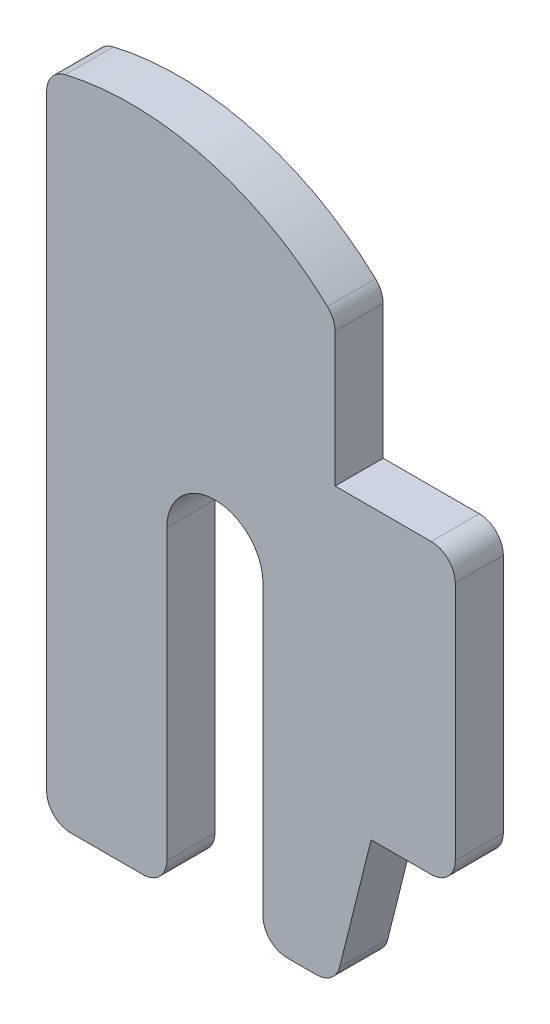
ISO-10303-21;
HEADER;
FILE_DESCRIPTION(('STEP AP214'),'2;1');
FILE_NAME('part.step','',(''),(''),'','','');
FILE_SCHEMA(('AUTOMOTIVE_DESIGN { 1 0 10303 214 1 1 1 1 }'));
ENDSEC;
DATA;
#1=APPLICATION_CONTEXT('core data for automotive mechanical design processes');
#2=APPLICATION_PROTOCOL_DEFINITION('international standard','automotive_design',2000,#1);
#3=PRODUCT_CONTEXT('',#1,'mechanical');
#4=PRODUCT('Part','Part','',(#3));
#5=PRODUCT_RELATED_PRODUCT_CATEGORY('part','',(#4));
#6=PRODUCT_DEFINITION_FORMATION('','',#4);
#7=PRODUCT_DEFINITION_CONTEXT('part definition',#1,'design');
#8=PRODUCT_DEFINITION('design','',#6,#7);
#9=PRODUCT_DEFINITION_SHAPE('','',#8);
#10=(LENGTH_UNIT() NAMED_UNIT(*) SI_UNIT(.MILLI.,.METRE.));
#11=(NAMED_UNIT(*) PLANE_ANGLE_UNIT() SI_UNIT($,.RADIAN.));
#12=(NAMED_UNIT(*) SI_UNIT($,.STERADIAN.) SOLID_ANGLE_UNIT());
#13=UNCERTAINTY_MEASURE_WITH_UNIT(LENGTH_MEASURE(1.E-05),#10,'distance_accuracy_value','');
#14=(GEOMETRIC_REPRESENTATION_CONTEXT(3) GLOBAL_UNCERTAINTY_ASSIGNED_CONTEXT((#13)) GLOBAL_UNIT_ASSIGNED_CONTEXT((#10,
#11,#12)) REPRESENTATION_CONTEXT('',''));
#15=CARTESIAN_POINT('',(0.,0.,0.));
#16=DIRECTION('',(0.,0.,1.));
#17=DIRECTION('',(1.,0.,0.));
#18=AXIS2_PLACEMENT_3D('',#15,#16,#17);
#19=CARTESIAN_POINT('',(12.,18.,2.));
#20=DIRECTION('',(0.,-1.,0.));
#21=DIRECTION('',(0.,0.,-1.));
#22=AXIS2_PLACEMENT_3D('',#19,#20,#21);
#23=PLANE('',#22);
#24=DIRECTION('',(-1.,0.,0.));
#25=VECTOR('',#24,1.);
#26=CARTESIAN_POINT('',(12.,18.,0.));
#27=LINE('',#26,#25);
#28=CARTESIAN_POINT('',(16.,18.,0.));
#29=VERTEX_POINT('',#28);
#30=CARTESIAN_POINT('',(12.,18.,0.));
#31=VERTEX_POINT('',#30);
#32=EDGE_CURVE('E200',#29,#31,#27,.T.);
#33=ORIENTED_EDGE('',*,*,#32,.T.);
#34=DIRECTION('',(0.,0.,-1.));
#35=VECTOR('',#34,1.);
#36=CARTESIAN_POINT('',(12.,18.,2.));
#37=LINE('',#36,#35);
#38=CARTESIAN_POINT('',(12.,18.,2.));
#39=VERTEX_POINT('',#38);
#40=EDGE_CURVE('E11',#39,#31,#37,.T.);
#41=ORIENTED_EDGE('',*,*,#40,.F.);
#42=DIRECTION('',(-1.,0.,0.));
#43=VECTOR('',#42,1.);
#44=CARTESIAN_POINT('',(12.,18.,2.));
#45=LINE('',#44,#43);
#46=CARTESIAN_POINT('',(16.,18.,2.));
#47=VERTEX_POINT('',#46);
#48=EDGE_CURVE('E238',#47,#39,#45,.T.);
#49=ORIENTED_EDGE('',*,*,#48,.F.);
#50=DIRECTION('',(0.,0.,-1.));
#51=VECTOR('',#50,1.);
#52=CARTESIAN_POINT('',(16.,18.,2.));
#53=LINE('',#52,#51);
#54=EDGE_CURVE('E196',#47,#29,#53,.T.);
#55=ORIENTED_EDGE('',*,*,#54,.T.);
#56=EDGE_LOOP('',(#33,#41,#49,#55));
#57=FACE_BOUND('',#56,.T.);
#58=ADVANCED_FACE('F32',(#57),#23,.F.);
#59=CARTESIAN_POINT('',(12.,23.5757807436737,2.));
#60=DIRECTION('',(-1.,0.,0.));
#61=DIRECTION('',(0.,0.,1.));
#62=AXIS2_PLACEMENT_3D('',#59,#60,#61);
#63=PLANE('',#62);
#64=DIRECTION('',(0.,1.,0.));
#65=VECTOR('',#64,1.);
#66=CARTESIAN_POINT('',(12.,23.5757807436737,0.));
#67=LINE('',#66,#65);
#68=CARTESIAN_POINT('',(12.,23.5757807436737,0.));
#69=VERTEX_POINT('',#68);
#70=EDGE_CURVE('E203',#31,#69,#67,.T.);
#71=ORIENTED_EDGE('',*,*,#70,.T.);
#72=DIRECTION('',(0.,0.,-1.));
#73=VECTOR('',#72,1.);
#74=CARTESIAN_POINT('',(12.,23.5757807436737,2.));
#75=LINE('',#74,#73);
#76=CARTESIAN_POINT('',(12.,23.5757807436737,2.));
#77=VERTEX_POINT('',#76);
#78=EDGE_CURVE('E40',#77,#69,#75,.T.);
#79=ORIENTED_EDGE('',*,*,#78,.F.);
#80=DIRECTION('',(0.,1.,0.));
#81=VECTOR('',#80,1.);
#82=CARTESIAN_POINT('',(12.,23.5757807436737,2.));
#83=LINE('',#82,#81);
#84=EDGE_CURVE('E127',#39,#77,#83,.T.);
#85=ORIENTED_EDGE('',*,*,#84,.F.);
#86=ORIENTED_EDGE('',*,*,#40,.T.);
#87=EDGE_LOOP('',(#71,#79,#85,#86));
#88=FACE_BOUND('',#87,.T.);
#89=ADVANCED_FACE('F356',(#88),#63,.F.);
#90=CARTESIAN_POINT('',(11.,23.5757807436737,2.));
#91=DIRECTION('',(0.,0.,-1.));
#92=DIRECTION('',(-1.,0.,0.));
#93=AXIS2_PLACEMENT_3D('',#90,#91,#92);
#94=CYLINDRICAL_SURFACE('',#93,1.);
#95=CARTESIAN_POINT('',(11.,23.5757807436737,0.));
#96=DIRECTION('',(0.,0.,1.));
#97=DIRECTION('',(-1.,0.,0.));
#98=AXIS2_PLACEMENT_3D('',#95,#96,#97);
#99=CIRCLE('',#98,1.);
#100=CARTESIAN_POINT('',(11.6812827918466,24.3078010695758,0.));
#101=VERTEX_POINT('',#100);
#102=EDGE_CURVE('E205',#69,#101,#99,.T.);
#103=ORIENTED_EDGE('',*,*,#102,.T.);
#104=DIRECTION('',(0.,0.,-1.));
#105=VECTOR('',#104,1.);
#106=CARTESIAN_POINT('',(11.6812827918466,24.3078010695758,2.));
#107=LINE('',#106,#105);
#108=CARTESIAN_POINT('',(11.6812827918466,24.3078010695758,2.));
#109=VERTEX_POINT('',#108);
#110=EDGE_CURVE('E281',#109,#101,#107,.T.);
#111=ORIENTED_EDGE('',*,*,#110,.F.);
#112=CARTESIAN_POINT('',(11.,23.5757807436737,2.));
#113=DIRECTION('',(0.,0.,1.));
#114=DIRECTION('',(-1.,0.,0.));
#115=AXIS2_PLACEMENT_3D('',#112,#113,#114);
#116=CIRCLE('',#115,1.);
#117=EDGE_CURVE('E289',#77,#109,#116,.T.);
#118=ORIENTED_EDGE('',*,*,#117,.F.);
#119=ORIENTED_EDGE('',*,*,#78,.T.);
#120=EDGE_LOOP('',(#103,#111,#118,#119));
#121=FACE_BOUND('',#120,.T.);
#122=ADVANCED_FACE('F287',(#121),#94,.T.);
#123=CARTESIAN_POINT('',(3.50588928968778,15.5235571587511,2.));
#124=DIRECTION('',(0.,0.,-1.));
#125=DIRECTION('',(-1.,0.,0.));
#126=AXIS2_PLACEMENT_3D('',#123,#124,#125);
#127=CYLINDRICAL_SURFACE('',#126,12.);
#128=CARTESIAN_POINT('',(3.50588928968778,15.5235571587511,0.));
#129=DIRECTION('',(0.,0.,1.));
#130=DIRECTION('',(-1.,0.,0.));
#131=AXIS2_PLACEMENT_3D('',#128,#129,#130);
#132=CIRCLE('',#131,12.);
#133=CARTESIAN_POINT('',(0.772191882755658,27.2080296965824,0.));
#134=VERTEX_POINT('',#133);
#135=EDGE_CURVE('E207',#101,#134,#132,.T.);
#136=ORIENTED_EDGE('',*,*,#135,.T.);
#137=DIRECTION('',(0.,0.,-1.));
#138=VECTOR('',#137,1.);
#139=CARTESIAN_POINT('',(0.772191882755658,27.2080296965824,2.));
#140=LINE('',#139,#138);
#141=CARTESIAN_POINT('',(0.772191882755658,27.2080296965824,2.));
#142=VERTEX_POINT('',#141);
#143=EDGE_CURVE('E278',#142,#134,#140,.T.);
#144=ORIENTED_EDGE('',*,*,#143,.F.);
#145=CARTESIAN_POINT('',(3.50588928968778,15.5235571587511,2.));
#146=DIRECTION('',(0.,0.,1.));
#147=DIRECTION('',(-1.,0.,0.));
#148=AXIS2_PLACEMENT_3D('',#145,#146,#147);
#149=CIRCLE('',#148,12.);
#150=EDGE_CURVE('E307',#109,#142,#149,.T.);
#151=ORIENTED_EDGE('',*,*,#150,.F.);
#152=ORIENTED_EDGE('',*,*,#110,.T.);
#153=EDGE_LOOP('',(#136,#144,#151,#152));
#154=FACE_BOUND('',#153,.T.);
#155=ADVANCED_FACE('F298',(#154),#127,.T.);
#156=CARTESIAN_POINT('',(1.,26.2343236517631,2.));
#157=DIRECTION('',(0.,0.,-1.));
#158=DIRECTION('',(-1.,0.,0.));
#159=AXIS2_PLACEMENT_3D('',#156,#157,#158);
#160=CYLINDRICAL_SURFACE('',#159,1.);
#161=CARTESIAN_POINT('',(1.,26.2343236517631,0.));
#162=DIRECTION('',(0.,0.,1.));
#163=DIRECTION('',(-1.,0.,0.));
#164=AXIS2_PLACEMENT_3D('',#161,#162,#163);
#165=CIRCLE('',#164,1.);
#166=CARTESIAN_POINT('',(0.,26.2343236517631,0.));
#167=VERTEX_POINT('',#166);
#168=EDGE_CURVE('E209',#134,#167,#165,.T.);
#169=ORIENTED_EDGE('',*,*,#168,.T.);
#170=DIRECTION('',(0.,0.,-1.));
#171=VECTOR('',#170,1.);
#172=CARTESIAN_POINT('',(0.,26.2343236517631,2.));
#173=LINE('',#172,#171);
#174=CARTESIAN_POINT('',(0.,26.2343236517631,2.));
#175=VERTEX_POINT('',#174);
#176=EDGE_CURVE('E275',#175,#167,#173,.T.);
#177=ORIENTED_EDGE('',*,*,#176,.F.);
#178=CARTESIAN_POINT('',(1.,26.2343236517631,2.));
#179=DIRECTION('',(0.,0.,1.));
#180=DIRECTION('',(-1.,0.,0.));
#181=AXIS2_PLACEMENT_3D('',#178,#179,#180);
#182=CIRCLE('',#181,1.);
#183=EDGE_CURVE('E304',#142,#175,#182,.T.);
#184=ORIENTED_EDGE('',*,*,#183,.F.);
#185=ORIENTED_EDGE('',*,*,#143,.T.);
#186=EDGE_LOOP('',(#169,#177,#184,#185));
#187=FACE_BOUND('',#186,.T.);
#188=ADVANCED_FACE('F302',(#187),#160,.T.);
#189=CARTESIAN_POINT('',(0.,1.00000000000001,2.));
#190=DIRECTION('',(1.,0.,0.));
#191=DIRECTION('',(0.,0.,-1.));
#192=AXIS2_PLACEMENT_3D('',#189,#190,#191);
#193=PLANE('',#192);
#194=DIRECTION('',(0.,-1.,0.));
#195=VECTOR('',#194,1.);
#196=CARTESIAN_POINT('',(0.,1.00000000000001,0.));
#197=LINE('',#196,#195);
#198=CARTESIAN_POINT('',(0.,1.00000000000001,0.));
#199=VERTEX_POINT('',#198);
#200=EDGE_CURVE('E211',#167,#199,#197,.T.);
#201=ORIENTED_EDGE('',*,*,#200,.T.);
#202=DIRECTION('',(0.,0.,-1.));
#203=VECTOR('',#202,1.);
#204=CARTESIAN_POINT('',(0.,1.00000000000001,2.));
#205=LINE('',#204,#203);
#206=CARTESIAN_POINT('',(0.,1.00000000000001,2.));
#207=VERTEX_POINT('',#206);
#208=EDGE_CURVE('E272',#207,#199,#205,.T.);
#209=ORIENTED_EDGE('',*,*,#208,.F.);
#210=DIRECTION('',(0.,-1.,0.));
#211=VECTOR('',#210,1.);
#212=CARTESIAN_POINT('',(0.,1.00000000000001,2.));
#213=LINE('',#212,#211);
#214=EDGE_CURVE('E306',#175,#207,#213,.T.);
#215=ORIENTED_EDGE('',*,*,#214,.F.);
#216=ORIENTED_EDGE('',*,*,#176,.T.);
#217=EDGE_LOOP('',(#201,#209,#215,#216));
#218=FACE_BOUND('',#217,.T.);
#219=ADVANCED_FACE('F369',(#218),#193,.F.);
#220=CARTESIAN_POINT('',(1.,1.,2.));
#221=DIRECTION('',(0.,0.,-1.));
#222=DIRECTION('',(-1.,0.,0.));
#223=AXIS2_PLACEMENT_3D('',#220,#221,#222);
#224=CYLINDRICAL_SURFACE('',#223,1.);
#225=CARTESIAN_POINT('',(1.,1.,0.));
#226=DIRECTION('',(0.,0.,1.));
#227=DIRECTION('',(1.,0.,0.));
#228=AXIS2_PLACEMENT_3D('',#225,#226,#227);
#229=CIRCLE('',#228,1.);
#230=CARTESIAN_POINT('',(1.00000000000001,0.,0.));
#231=VERTEX_POINT('',#230);
#232=EDGE_CURVE('E213',#199,#231,#229,.T.);
#233=ORIENTED_EDGE('',*,*,#232,.T.);
#234=DIRECTION('',(0.,0.,-1.));
#235=VECTOR('',#234,1.);
#236=CARTESIAN_POINT('',(1.00000000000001,0.,2.));
#237=LINE('',#236,#235);
#238=CARTESIAN_POINT('',(1.00000000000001,0.,2.));
#239=VERTEX_POINT('',#238);
#240=EDGE_CURVE('E269',#239,#231,#237,.T.);
#241=ORIENTED_EDGE('',*,*,#240,.F.);
#242=CARTESIAN_POINT('',(1.,1.,2.));
#243=DIRECTION('',(0.,0.,1.));
#244=DIRECTION('',(1.,0.,0.));
#245=AXIS2_PLACEMENT_3D('',#242,#243,#244);
#246=CIRCLE('',#245,1.);
#247=EDGE_CURVE('E309',#207,#239,#246,.T.);
#248=ORIENTED_EDGE('',*,*,#247,.F.);
#249=ORIENTED_EDGE('',*,*,#208,.T.);
#250=EDGE_LOOP('',(#233,#241,#248,#249));
#251=FACE_BOUND('',#250,.T.);
#252=ADVANCED_FACE('F372',(#251),#224,.T.);
#253=CARTESIAN_POINT('',(1.00000000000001,0.,2.));
#254=DIRECTION('',(0.,1.,0.));
#255=DIRECTION('',(0.,0.,1.));
#256=AXIS2_PLACEMENT_3D('',#253,#254,#255);
#257=PLANE('',#256);
#258=DIRECTION('',(1.,0.,0.));
#259=VECTOR('',#258,1.);
#260=CARTESIAN_POINT('',(1.00000000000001,0.,0.));
#261=LINE('',#260,#259);
#262=CARTESIAN_POINT('',(3.99999999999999,0.,0.));
#263=VERTEX_POINT('',#262);
#264=EDGE_CURVE('E215',#231,#263,#261,.T.);
#265=ORIENTED_EDGE('',*,*,#264,.T.);
#266=DIRECTION('',(0.,0.,-1.));
#267=VECTOR('',#266,1.);
#268=CARTESIAN_POINT('',(3.99999999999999,0.,2.));
#269=LINE('',#268,#267);
#270=CARTESIAN_POINT('',(3.99999999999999,0.,2.));
#271=VERTEX_POINT('',#270);
#272=EDGE_CURVE('E266',#271,#263,#269,.T.);
#273=ORIENTED_EDGE('',*,*,#272,.F.);
#274=DIRECTION('',(1.,0.,0.));
#275=VECTOR('',#274,1.);
#276=CARTESIAN_POINT('',(1.00000000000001,0.,2.));
#277=LINE('',#276,#275);
#278=EDGE_CURVE('E315',#239,#271,#277,.T.);
#279=ORIENTED_EDGE('',*,*,#278,.F.);
#280=ORIENTED_EDGE('',*,*,#240,.T.);
#281=EDGE_LOOP('',(#265,#273,#279,#280));
#282=FACE_BOUND('',#281,.T.);
#283=ADVANCED_FACE('F376',(#282),#257,.F.);
#284=CARTESIAN_POINT('',(4.,1.,2.));
#285=DIRECTION('',(0.,0.,-1.));
#286=DIRECTION('',(-1.,0.,0.));
#287=AXIS2_PLACEMENT_3D('',#284,#285,#286);
#288=CYLINDRICAL_SURFACE('',#287,1.);
#289=CARTESIAN_POINT('',(4.,1.,0.));
#290=DIRECTION('',(0.,0.,1.));
#291=DIRECTION('',(1.,0.,0.));
#292=AXIS2_PLACEMENT_3D('',#289,#290,#291);
#293=CIRCLE('',#292,1.);
#294=CARTESIAN_POINT('',(5.,1.00000000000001,0.));
#295=VERTEX_POINT('',#294);
#296=EDGE_CURVE('E217',#263,#295,#293,.T.);
#297=ORIENTED_EDGE('',*,*,#296,.T.);
#298=DIRECTION('',(0.,0.,-1.));
#299=VECTOR('',#298,1.);
#300=CARTESIAN_POINT('',(5.,1.00000000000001,2.));
#301=LINE('',#300,#299);
#302=CARTESIAN_POINT('',(5.,1.00000000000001,2.));
#303=VERTEX_POINT('',#302);
#304=EDGE_CURVE('E263',#303,#295,#301,.T.);
#305=ORIENTED_EDGE('',*,*,#304,.F.);
#306=CARTESIAN_POINT('',(4.,1.,2.));
#307=DIRECTION('',(0.,0.,1.));
#308=DIRECTION('',(1.,0.,0.));
#309=AXIS2_PLACEMENT_3D('',#306,#307,#308);
#310=CIRCLE('',#309,1.);
#311=EDGE_CURVE('E317',#271,#303,#310,.T.);
#312=ORIENTED_EDGE('',*,*,#311,.F.);
#313=ORIENTED_EDGE('',*,*,#272,.T.);
#314=EDGE_LOOP('',(#297,#305,#312,#313));
#315=FACE_BOUND('',#314,.T.);
#316=ADVANCED_FACE('F380',(#315),#288,.T.);
#317=CARTESIAN_POINT('',(5.,1.00000000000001,2.));
#318=DIRECTION('',(-1.,0.,0.));
#319=DIRECTION('',(0.,0.,1.));
#320=AXIS2_PLACEMENT_3D('',#317,#318,#319);
#321=PLANE('',#320);
#322=DIRECTION('',(0.,1.,0.));
#323=VECTOR('',#322,1.);
#324=CARTESIAN_POINT('',(5.,1.00000000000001,0.));
#325=LINE('',#324,#323);
#326=CARTESIAN_POINT('',(5.,13.,0.));
#327=VERTEX_POINT('',#326);
#328=EDGE_CURVE('E219',#295,#327,#325,.T.);
#329=ORIENTED_EDGE('',*,*,#328,.T.);
#330=DIRECTION('',(0.,0.,-1.));
#331=VECTOR('',#330,1.);
#332=CARTESIAN_POINT('',(5.,13.,2.));
#333=LINE('',#332,#331);
#334=CARTESIAN_POINT('',(5.,13.,2.));
#335=VERTEX_POINT('',#334);
#336=EDGE_CURVE('E260',#335,#327,#333,.T.);
#337=ORIENTED_EDGE('',*,*,#336,.F.);
#338=DIRECTION('',(0.,1.,0.));
#339=VECTOR('',#338,1.);
#340=CARTESIAN_POINT('',(5.,1.00000000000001,2.));
#341=LINE('',#340,#339);
#342=EDGE_CURVE('E319',#303,#335,#341,.T.);
#343=ORIENTED_EDGE('',*,*,#342,.F.);
#344=ORIENTED_EDGE('',*,*,#304,.T.);
#345=EDGE_LOOP('',(#329,#337,#343,#344));
#346=FACE_BOUND('',#345,.T.);
#347=ADVANCED_FACE('F384',(#346),#321,.F.);
#348=CARTESIAN_POINT('',(7.,13.,2.));
#349=DIRECTION('',(0.,0.,-1.));
#350=DIRECTION('',(-1.,0.,0.));
#351=AXIS2_PLACEMENT_3D('',#348,#349,#350);
#352=CYLINDRICAL_SURFACE('',#351,2.);
#353=CARTESIAN_POINT('',(7.,13.,0.));
#354=DIRECTION('',(0.,0.,-1.));
#355=DIRECTION('',(1.,0.,0.));
#356=AXIS2_PLACEMENT_3D('',#353,#354,#355);
#357=CIRCLE('',#356,2.);
#358=CARTESIAN_POINT('',(9.,13.,0.));
#359=VERTEX_POINT('',#358);
#360=EDGE_CURVE('E221',#327,#359,#357,.T.);
#361=ORIENTED_EDGE('',*,*,#360,.T.);
#362=DIRECTION('',(0.,0.,-1.));
#363=VECTOR('',#362,1.);
#364=CARTESIAN_POINT('',(9.,13.,2.));
#365=LINE('',#364,#363);
#366=CARTESIAN_POINT('',(9.,13.,2.));
#367=VERTEX_POINT('',#366);
#368=EDGE_CURVE('E257',#367,#359,#365,.T.);
#369=ORIENTED_EDGE('',*,*,#368,.F.);
#370=CARTESIAN_POINT('',(7.,13.,2.));
#371=DIRECTION('',(0.,0.,-1.));
#372=DIRECTION('',(1.,0.,0.));
#373=AXIS2_PLACEMENT_3D('',#370,#371,#372);
#374=CIRCLE('',#373,2.);
#375=EDGE_CURVE('E321',#335,#367,#374,.T.);
#376=ORIENTED_EDGE('',*,*,#375,.F.);
#377=ORIENTED_EDGE('',*,*,#336,.T.);
#378=EDGE_LOOP('',(#361,#369,#376,#377));
#379=FACE_BOUND('',#378,.T.);
#380=ADVANCED_FACE('F388',(#379),#352,.F.);
#381=CARTESIAN_POINT('',(9.,1.00000000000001,2.));
#382=DIRECTION('',(1.,0.,0.));
#383=DIRECTION('',(0.,0.,-1.));
#384=AXIS2_PLACEMENT_3D('',#381,#382,#383);
#385=PLANE('',#384);
#386=DIRECTION('',(0.,-1.,0.));
#387=VECTOR('',#386,1.);
#388=CARTESIAN_POINT('',(9.,1.00000000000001,0.));
#389=LINE('',#388,#387);
#390=CARTESIAN_POINT('',(9.,1.00000000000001,0.));
#391=VERTEX_POINT('',#390);
#392=EDGE_CURVE('E223',#359,#391,#389,.T.);
#393=ORIENTED_EDGE('',*,*,#392,.T.);
#394=DIRECTION('',(0.,0.,-1.));
#395=VECTOR('',#394,1.);
#396=CARTESIAN_POINT('',(9.,1.00000000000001,2.));
#397=LINE('',#396,#395);
#398=CARTESIAN_POINT('',(9.,1.00000000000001,2.));
#399=VERTEX_POINT('',#398);
#400=EDGE_CURVE('E254',#399,#391,#397,.T.);
#401=ORIENTED_EDGE('',*,*,#400,.F.);
#402=DIRECTION('',(0.,-1.,0.));
#403=VECTOR('',#402,1.);
#404=CARTESIAN_POINT('',(9.,1.00000000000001,2.));
#405=LINE('',#404,#403);
#406=EDGE_CURVE('E323',#367,#399,#405,.T.);
#407=ORIENTED_EDGE('',*,*,#406,.F.);
#408=ORIENTED_EDGE('',*,*,#368,.T.);
#409=EDGE_LOOP('',(#393,#401,#407,#408));
#410=FACE_BOUND('',#409,.T.);
#411=ADVANCED_FACE('F392',(#410),#385,.F.);
#412=CARTESIAN_POINT('',(10.,1.,2.));
#413=DIRECTION('',(0.,0.,-1.));
#414=DIRECTION('',(-1.,0.,0.));
#415=AXIS2_PLACEMENT_3D('',#412,#413,#414);
#416=CYLINDRICAL_SURFACE('',#415,1.);
#417=CARTESIAN_POINT('',(10.,1.,0.));
#418=DIRECTION('',(0.,0.,1.));
#419=DIRECTION('',(-1.,0.,0.));
#420=AXIS2_PLACEMENT_3D('',#417,#418,#419);
#421=CIRCLE('',#420,1.);
#422=CARTESIAN_POINT('',(10.,0.,0.));
#423=VERTEX_POINT('',#422);
#424=EDGE_CURVE('E225',#391,#423,#421,.T.);
#425=ORIENTED_EDGE('',*,*,#424,.T.);
#426=DIRECTION('',(0.,0.,-1.));
#427=VECTOR('',#426,1.);
#428=CARTESIAN_POINT('',(10.,0.,2.));
#429=LINE('',#428,#427);
#430=CARTESIAN_POINT('',(10.,0.,2.));
#431=VERTEX_POINT('',#430);
#432=EDGE_CURVE('E251',#431,#423,#429,.T.);
#433=ORIENTED_EDGE('',*,*,#432,.F.);
#434=CARTESIAN_POINT('',(10.,1.,2.));
#435=DIRECTION('',(0.,0.,1.));
#436=DIRECTION('',(-1.,0.,0.));
#437=AXIS2_PLACEMENT_3D('',#434,#435,#436);
#438=CIRCLE('',#437,1.);
#439=EDGE_CURVE('E325',#399,#431,#438,.T.);
#440=ORIENTED_EDGE('',*,*,#439,.F.);
#441=ORIENTED_EDGE('',*,*,#400,.T.);
#442=EDGE_LOOP('',(#425,#433,#440,#441));
#443=FACE_BOUND('',#442,.T.);
#444=ADVANCED_FACE('F396',(#443),#416,.T.);
#445=CARTESIAN_POINT('',(11.2192235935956,0.,2.));
#446=DIRECTION('',(0.,1.,0.));
#447=DIRECTION('',(-1.,0.,0.));
#448=AXIS2_PLACEMENT_3D('',#445,#446,#447);
#449=PLANE('',#448);
#450=DIRECTION('',(1.,0.,0.));
#451=VECTOR('',#450,1.);
#452=CARTESIAN_POINT('',(11.2192235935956,0.,0.));
#453=LINE('',#452,#451);
#454=CARTESIAN_POINT('',(11.2192235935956,0.,0.));
#455=VERTEX_POINT('',#454);
#456=EDGE_CURVE('E227',#423,#455,#453,.T.);
#457=ORIENTED_EDGE('',*,*,#456,.T.);
#458=DIRECTION('',(0.,0.,-1.));
#459=VECTOR('',#458,1.);
#460=CARTESIAN_POINT('',(11.2192235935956,0.,2.));
#461=LINE('',#460,#459);
#462=CARTESIAN_POINT('',(11.2192235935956,0.,2.));
#463=VERTEX_POINT('',#462);
#464=EDGE_CURVE('E248',#463,#455,#461,.T.);
#465=ORIENTED_EDGE('',*,*,#464,.F.);
#466=DIRECTION('',(1.,0.,0.));
#467=VECTOR('',#466,1.);
#468=CARTESIAN_POINT('',(11.2192235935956,0.,2.));
#469=LINE('',#468,#467);
#470=EDGE_CURVE('E327',#431,#463,#469,.T.);
#471=ORIENTED_EDGE('',*,*,#470,.F.);
#472=ORIENTED_EDGE('',*,*,#432,.T.);
#473=EDGE_LOOP('',(#457,#465,#471,#472));
#474=FACE_BOUND('',#473,.T.);
#475=ADVANCED_FACE('F400',(#474),#449,.F.);
#476=CARTESIAN_POINT('',(11.2192235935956,1.,2.));
#477=DIRECTION('',(0.,0.,-1.));
#478=DIRECTION('',(-1.,0.,0.));
#479=AXIS2_PLACEMENT_3D('',#476,#477,#478);
#480=CYLINDRICAL_SURFACE('',#479,0.999999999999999);
#481=CARTESIAN_POINT('',(11.2192235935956,1.,0.));
#482=DIRECTION('',(0.,0.,1.));
#483=DIRECTION('',(-1.,0.,0.));
#484=AXIS2_PLACEMENT_3D('',#481,#482,#483);
#485=CIRCLE('',#484,0.999999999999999);
#486=CARTESIAN_POINT('',(12.1893660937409,0.757464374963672,0.));
#487=VERTEX_POINT('',#486);
#488=EDGE_CURVE('E229',#455,#487,#485,.T.);
#489=ORIENTED_EDGE('',*,*,#488,.T.);
#490=DIRECTION('',(0.,0.,-1.));
#491=VECTOR('',#490,1.);
#492=CARTESIAN_POINT('',(12.1893660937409,0.757464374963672,2.));
#493=LINE('',#492,#491);
#494=CARTESIAN_POINT('',(12.1893660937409,0.757464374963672,2.));
#495=VERTEX_POINT('',#494);
#496=EDGE_CURVE('E245',#495,#487,#493,.T.);
#497=ORIENTED_EDGE('',*,*,#496,.F.);
#498=CARTESIAN_POINT('',(11.2192235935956,1.,2.));
#499=DIRECTION('',(0.,0.,1.));
#500=DIRECTION('',(-1.,0.,0.));
#501=AXIS2_PLACEMENT_3D('',#498,#499,#500);
#502=CIRCLE('',#501,0.999999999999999);
#503=EDGE_CURVE('E329',#463,#495,#502,.T.);
#504=ORIENTED_EDGE('',*,*,#503,.F.);
#505=ORIENTED_EDGE('',*,*,#464,.T.);
#506=EDGE_LOOP('',(#489,#497,#504,#505));
#507=FACE_BOUND('',#506,.T.);
#508=ADVANCED_FACE('F404',(#507),#480,.T.);
#509=CARTESIAN_POINT('',(13.5,6.,2.));
#510=DIRECTION('',(-0.970142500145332,0.242535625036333,0.));
#511=DIRECTION('',(-0.242535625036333,-0.970142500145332,0.));
#512=AXIS2_PLACEMENT_3D('',#509,#510,#511);
#513=PLANE('',#512);
#514=DIRECTION('',(0.242535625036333,0.970142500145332,0.));
#515=VECTOR('',#514,1.);
#516=CARTESIAN_POINT('',(13.5,6.,0.));
#517=LINE('',#516,#515);
#518=CARTESIAN_POINT('',(13.5,6.,0.));
#519=VERTEX_POINT('',#518);
#520=EDGE_CURVE('E231',#487,#519,#517,.T.);
#521=ORIENTED_EDGE('',*,*,#520,.T.);
#522=DIRECTION('',(0.,0.,-1.));
#523=VECTOR('',#522,1.);
#524=CARTESIAN_POINT('',(13.5,6.,2.));
#525=LINE('',#524,#523);
#526=CARTESIAN_POINT('',(13.5,6.,2.));
#527=VERTEX_POINT('',#526);
#528=EDGE_CURVE('E242',#527,#519,#525,.T.);
#529=ORIENTED_EDGE('',*,*,#528,.F.);
#530=DIRECTION('',(0.242535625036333,0.970142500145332,0.));
#531=VECTOR('',#530,1.);
#532=CARTESIAN_POINT('',(13.5,6.,2.));
#533=LINE('',#532,#531);
#534=EDGE_CURVE('E331',#495,#527,#533,.T.);
#535=ORIENTED_EDGE('',*,*,#534,.F.);
#536=ORIENTED_EDGE('',*,*,#496,.T.);
#537=EDGE_LOOP('',(#521,#529,#535,#536));
#538=FACE_BOUND('',#537,.T.);
#539=ADVANCED_FACE('F337',(#538),#513,.F.);
#540=CARTESIAN_POINT('',(16.,6.,2.));
#541=DIRECTION('',(0.,1.,0.));
#542=DIRECTION('',(0.,0.,1.));
#543=AXIS2_PLACEMENT_3D('',#540,#541,#542);
#544=PLANE('',#543);
#545=DIRECTION('',(1.,0.,0.));
#546=VECTOR('',#545,1.);
#547=CARTESIAN_POINT('',(16.,6.,0.));
#548=LINE('',#547,#546);
#549=CARTESIAN_POINT('',(16.,6.,0.));
#550=VERTEX_POINT('',#549);
#551=EDGE_CURVE('E233',#519,#550,#548,.T.);
#552=ORIENTED_EDGE('',*,*,#551,.T.);
#553=DIRECTION('',(0.,0.,-1.));
#554=VECTOR('',#553,1.);
#555=CARTESIAN_POINT('',(16.,6.,2.));
#556=LINE('',#555,#554);
#557=CARTESIAN_POINT('',(16.,6.,2.));
#558=VERTEX_POINT('',#557);
#559=EDGE_CURVE('E191',#558,#550,#556,.T.);
#560=ORIENTED_EDGE('',*,*,#559,.F.);
#561=DIRECTION('',(1.,0.,0.));
#562=VECTOR('',#561,1.);
#563=CARTESIAN_POINT('',(16.,6.,2.));
#564=LINE('',#563,#562);
#565=EDGE_CURVE('E182',#527,#558,#564,.T.);
#566=ORIENTED_EDGE('',*,*,#565,.F.);
#567=ORIENTED_EDGE('',*,*,#528,.T.);
#568=EDGE_LOOP('',(#552,#560,#566,#567));
#569=FACE_BOUND('',#568,.T.);
#570=ADVANCED_FACE('F341',(#569),#544,.F.);
#571=CARTESIAN_POINT('',(16.,7.,2.));
#572=DIRECTION('',(0.,0.,-1.));
#573=DIRECTION('',(-1.,0.,0.));
#574=AXIS2_PLACEMENT_3D('',#571,#572,#573);
#575=CYLINDRICAL_SURFACE('',#574,1.);
#576=CARTESIAN_POINT('',(16.,7.,0.));
#577=DIRECTION('',(0.,0.,1.));
#578=DIRECTION('',(-1.,0.,0.));
#579=AXIS2_PLACEMENT_3D('',#576,#577,#578);
#580=CIRCLE('',#579,1.);
#581=CARTESIAN_POINT('',(17.,7.,0.));
#582=VERTEX_POINT('',#581);
#583=EDGE_CURVE('E190',#550,#582,#580,.T.);
#584=ORIENTED_EDGE('',*,*,#583,.T.);
#585=DIRECTION('',(0.,0.,-1.));
#586=VECTOR('',#585,1.);
#587=CARTESIAN_POINT('',(17.,7.,2.));
#588=LINE('',#587,#586);
#589=CARTESIAN_POINT('',(17.,7.,2.));
#590=VERTEX_POINT('',#589);
#591=EDGE_CURVE('E187',#590,#582,#588,.T.);
#592=ORIENTED_EDGE('',*,*,#591,.F.);
#593=CARTESIAN_POINT('',(16.,7.,2.));
#594=DIRECTION('',(0.,0.,1.));
#595=DIRECTION('',(-1.,0.,0.));
#596=AXIS2_PLACEMENT_3D('',#593,#594,#595);
#597=CIRCLE('',#596,1.);
#598=EDGE_CURVE('E176',#558,#590,#597,.T.);
#599=ORIENTED_EDGE('',*,*,#598,.F.);
#600=ORIENTED_EDGE('',*,*,#559,.T.);
#601=EDGE_LOOP('',(#584,#592,#599,#600));
#602=FACE_BOUND('',#601,.T.);
#603=ADVANCED_FACE('F188',(#602),#575,.T.);
#604=CARTESIAN_POINT('',(17.,17.,2.));
#605=DIRECTION('',(-1.,0.,0.));
#606=DIRECTION('',(0.,0.,1.));
#607=AXIS2_PLACEMENT_3D('',#604,#605,#606);
#608=PLANE('',#607);
#609=DIRECTION('',(0.,1.,0.));
#610=VECTOR('',#609,1.);
#611=CARTESIAN_POINT('',(17.,17.,0.));
#612=LINE('',#611,#610);
#613=CARTESIAN_POINT('',(17.,17.,0.));
#614=VERTEX_POINT('',#613);
#615=EDGE_CURVE('E113',#582,#614,#612,.T.);
#616=ORIENTED_EDGE('',*,*,#615,.T.);
#617=DIRECTION('',(0.,0.,-1.));
#618=VECTOR('',#617,1.);
#619=CARTESIAN_POINT('',(17.,17.,2.));
#620=LINE('',#619,#618);
#621=CARTESIAN_POINT('',(17.,17.,2.));
#622=VERTEX_POINT('',#621);
#623=EDGE_CURVE('E192',#622,#614,#620,.T.);
#624=ORIENTED_EDGE('',*,*,#623,.F.);
#625=DIRECTION('',(0.,1.,0.));
#626=VECTOR('',#625,1.);
#627=CARTESIAN_POINT('',(17.,17.,2.));
#628=LINE('',#627,#626);
#629=EDGE_CURVE('E180',#590,#622,#628,.T.);
#630=ORIENTED_EDGE('',*,*,#629,.F.);
#631=ORIENTED_EDGE('',*,*,#591,.T.);
#632=EDGE_LOOP('',(#616,#624,#630,#631));
#633=FACE_BOUND('',#632,.T.);
#634=ADVANCED_FACE('F194',(#633),#608,.F.);
#635=CARTESIAN_POINT('',(16.,17.,2.));
#636=DIRECTION('',(0.,0.,-1.));
#637=DIRECTION('',(-1.,0.,0.));
#638=AXIS2_PLACEMENT_3D('',#635,#636,#637);
#639=CYLINDRICAL_SURFACE('',#638,1.);
#640=CARTESIAN_POINT('',(16.,17.,0.));
#641=DIRECTION('',(0.,0.,1.));
#642=DIRECTION('',(-1.,0.,0.));
#643=AXIS2_PLACEMENT_3D('',#640,#641,#642);
#644=CIRCLE('',#643,1.);
#645=EDGE_CURVE('E119',#614,#29,#644,.T.);
#646=ORIENTED_EDGE('',*,*,#645,.T.);
#647=ORIENTED_EDGE('',*,*,#54,.F.);
#648=CARTESIAN_POINT('',(16.,17.,2.));
#649=DIRECTION('',(0.,0.,1.));
#650=DIRECTION('',(-1.,0.,0.));
#651=AXIS2_PLACEMENT_3D('',#648,#649,#650);
#652=CIRCLE('',#651,1.);
#653=EDGE_CURVE('E48',#622,#47,#652,.T.);
#654=ORIENTED_EDGE('',*,*,#653,.F.);
#655=ORIENTED_EDGE('',*,*,#623,.T.);
#656=EDGE_LOOP('',(#646,#647,#654,#655));
#657=FACE_BOUND('',#656,.T.);
#658=ADVANCED_FACE('F345',(#657),#639,.T.);
#659=CARTESIAN_POINT('',(16.,17.,2.));
#660=DIRECTION('',(0.,0.,-1.));
#661=DIRECTION('',(-1.,0.,0.));
#662=AXIS2_PLACEMENT_3D('',#659,#660,#661);
#663=PLANE('',#662);
#664=ORIENTED_EDGE('',*,*,#48,.T.);
#665=ORIENTED_EDGE('',*,*,#84,.T.);
#666=ORIENTED_EDGE('',*,*,#117,.T.);
#667=ORIENTED_EDGE('',*,*,#150,.T.);
#668=ORIENTED_EDGE('',*,*,#183,.T.);
#669=ORIENTED_EDGE('',*,*,#214,.T.);
#670=ORIENTED_EDGE('',*,*,#247,.T.);
#671=ORIENTED_EDGE('',*,*,#278,.T.);
#672=ORIENTED_EDGE('',*,*,#311,.T.);
#673=ORIENTED_EDGE('',*,*,#342,.T.);
#674=ORIENTED_EDGE('',*,*,#375,.T.);
#675=ORIENTED_EDGE('',*,*,#406,.T.);
#676=ORIENTED_EDGE('',*,*,#439,.T.);
#677=ORIENTED_EDGE('',*,*,#470,.T.);
#678=ORIENTED_EDGE('',*,*,#503,.T.);
#679=ORIENTED_EDGE('',*,*,#534,.T.);
#680=ORIENTED_EDGE('',*,*,#565,.T.);
#681=ORIENTED_EDGE('',*,*,#598,.T.);
#682=ORIENTED_EDGE('',*,*,#629,.T.);
#683=ORIENTED_EDGE('',*,*,#653,.T.);
#684=EDGE_LOOP('',(#664,#665,#666,#667,#668,#669,#670,#671,#672,#673,#674,#675,#676,#677,#678,
#679,#680,#681,#682,#683));
#685=FACE_BOUND('',#684,.T.);
#686=ADVANCED_FACE('F178',(#685),#663,.F.);
#687=CARTESIAN_POINT('',(16.,17.,0.));
#688=DIRECTION('',(0.,0.,-1.));
#689=DIRECTION('',(-1.,0.,0.));
#690=AXIS2_PLACEMENT_3D('',#687,#688,#689);
#691=PLANE('',#690);
#692=ORIENTED_EDGE('',*,*,#32,.F.);
#693=ORIENTED_EDGE('',*,*,#645,.F.);
#694=ORIENTED_EDGE('',*,*,#615,.F.);
#695=ORIENTED_EDGE('',*,*,#583,.F.);
#696=ORIENTED_EDGE('',*,*,#551,.F.);
#697=ORIENTED_EDGE('',*,*,#520,.F.);
#698=ORIENTED_EDGE('',*,*,#488,.F.);
#699=ORIENTED_EDGE('',*,*,#456,.F.);
#700=ORIENTED_EDGE('',*,*,#424,.F.);
#701=ORIENTED_EDGE('',*,*,#392,.F.);
#702=ORIENTED_EDGE('',*,*,#360,.F.);
#703=ORIENTED_EDGE('',*,*,#328,.F.);
#704=ORIENTED_EDGE('',*,*,#296,.F.);
#705=ORIENTED_EDGE('',*,*,#264,.F.);
#706=ORIENTED_EDGE('',*,*,#232,.F.);
#707=ORIENTED_EDGE('',*,*,#200,.F.);
#708=ORIENTED_EDGE('',*,*,#168,.F.);
#709=ORIENTED_EDGE('',*,*,#135,.F.);
#710=ORIENTED_EDGE('',*,*,#102,.F.);
#711=ORIENTED_EDGE('',*,*,#70,.F.);
#712=EDGE_LOOP('',(#692,#693,#694,#695,#696,#697,#698,#699,#700,#701,#702,#703,#704,#705,#706,
#707,#708,#709,#710,#711));
#713=FACE_BOUND('',#712,.T.);
#714=ADVANCED_FACE('F293',(#713),#691,.T.);
#715=CLOSED_SHELL('',(#58,#89,#122,#155,#188,#219,#252,#283,#316,#347,#380,#411,#444,#475,#508,
#539,#570,#603,#634,#658,#686,#714));
#716=MANIFOLD_SOLID_BREP('B2',#715);
#717=ADVANCED_BREP_SHAPE_REPRESENTATION('',(#18,#716),#14);
#718=SHAPE_DEFINITION_REPRESENTATION(#9,#717);
ENDSEC;
END-ISO-10303-21;
